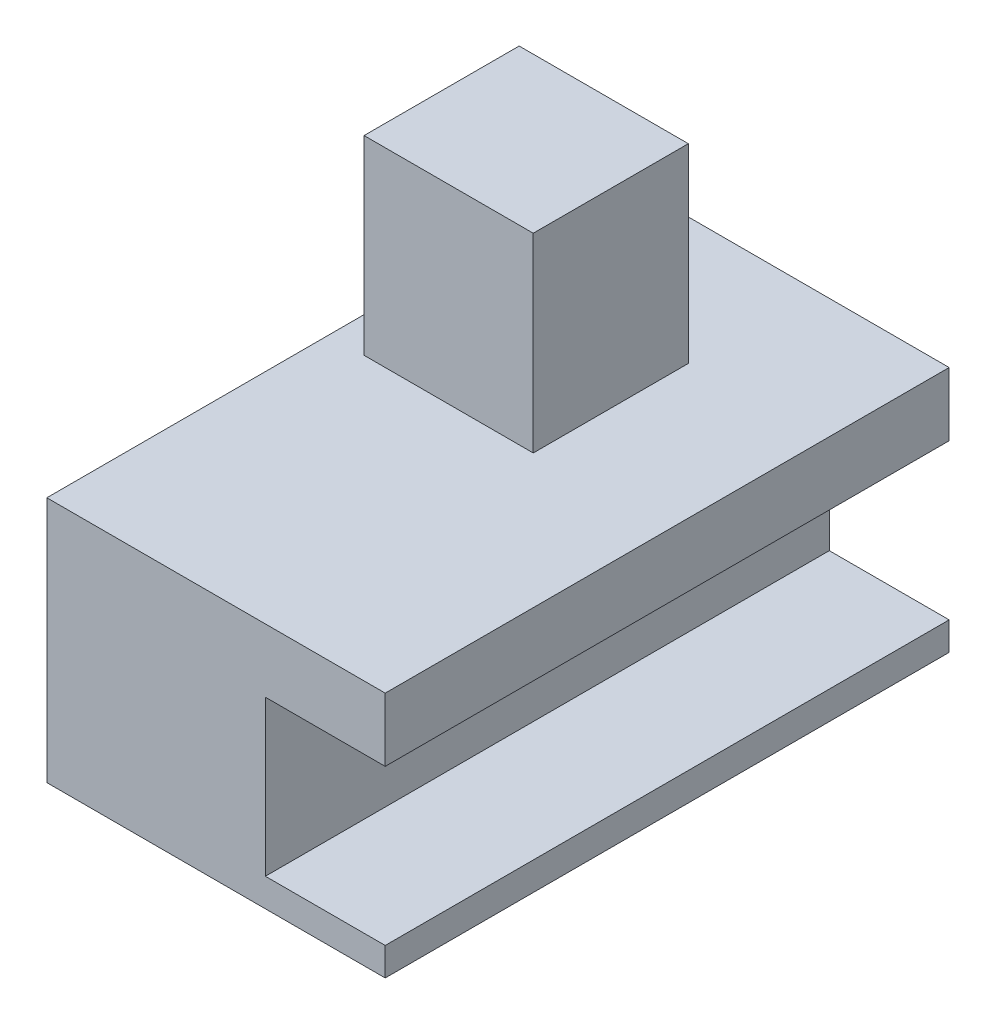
from build123d import *

# Parameters (mm, degrees)
EXTRUSION1_DEPTH = 80
ESQUISSE2_W      = 24
ESQUISSE2_H      = 22
EXTRUSION2_DEPTH = 27


with BuildPart() as part:
    # Esquisse1 → Extrusion1 (new body)
    with BuildSketch(Plane.XY):
        Polygon((48, 26), (31, 26), (31, 4), (48, 4), (48, 0), (0, 0), (0, 35), (48, 35), align=None)
    extrude(amount=-EXTRUSION1_DEPTH)

    # Esquisse2 → Extrusion2 (add)
    with BuildSketch(Plane(origin=(0, 35, 0), x_dir=(-1, 0, 0), z_dir=(0, 1, 0))):
        with Locations((-17, -51)):
            Rectangle(ESQUISSE2_W, ESQUISSE2_H)
    extrude(amount=EXTRUSION2_DEPTH)


solid = part.part
